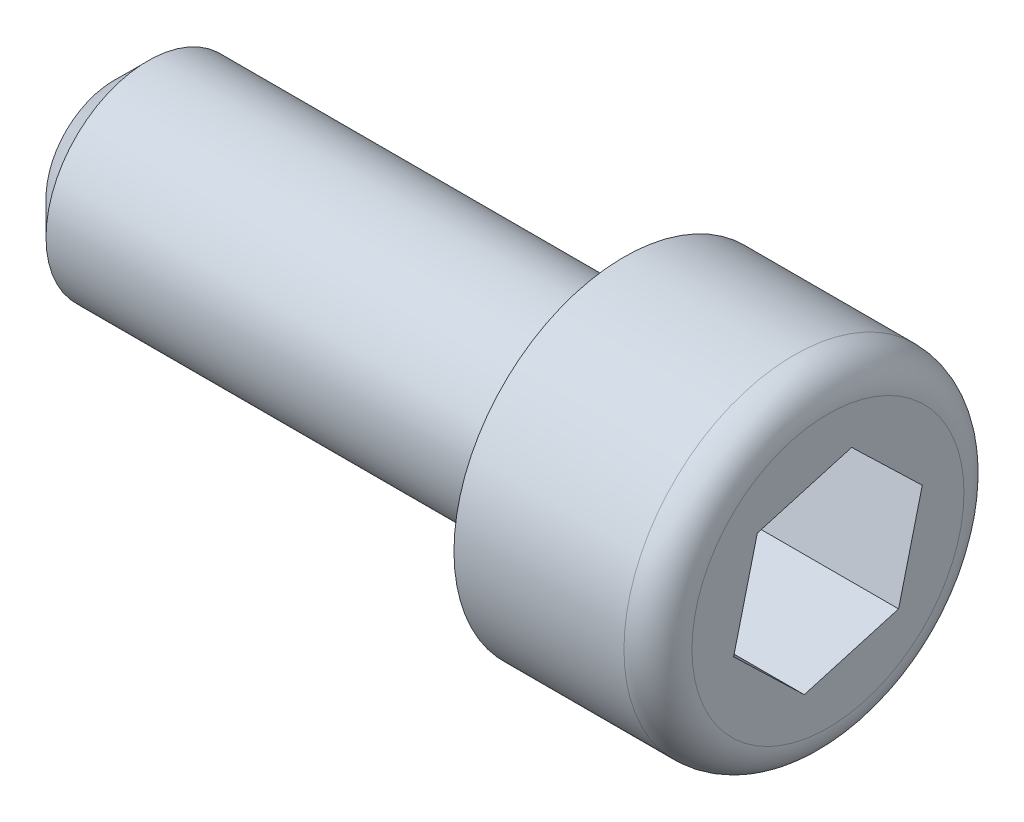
from build123d import *

# Parameters (mm, degrees)
CHANFREIN1_SIZE         = 1
CONG_1_R                = 1
ENL_V_MAT_EXTRU_1_DEPTH = 5


with BuildPart() as part:
    # Esquisse1 → Base-R_volution (revolve)
    with BuildSketch(Plane.XY, mode=Mode.PRIVATE) as base_r_volution_sk:
        Polygon((0, 0), (0, 5), (-6, 5), (-6, 3), (-21, 3), (-21, 0), align=None)
    revolve(base_r_volution_sk.sketch.rotate(Axis((-41, 0, 0), (1, 0, 0)), 90), axis=Axis((-41, 0, 0), (1, 0, 0)))

    # Chanfrein1
    chanfrein1_edges = [part.edges().sort_by_distance(p)[0] for p in [
        (-21, 0, -3),
    ]]
    chamfer(chanfrein1_edges, length=CHANFREIN1_SIZE)

    # Cong_1
    cong_1_edges = [part.edges().sort_by_distance(p)[0] for p in [
        (0, 0, -5),
    ]]
    fillet(cong_1_edges, radius=CONG_1_R)

    # Esquisse2 → Enl_v. mat.-Extru.1 (cut)
    with BuildSketch(Plane(origin=(0, 0, 0), x_dir=(0, 0, -1), z_dir=(1, 0, 0))):
        Polygon((2.078038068, -2.003769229), (2.774334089, 0.797749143), (0.696296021, 2.801518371), (-2.078038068, 2.003769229), (-2.774334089, -0.797749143), (-0.696296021, -2.801518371), align=None)
    extrude(amount=-ENL_V_MAT_EXTRU_1_DEPTH, mode=Mode.SUBTRACT)


solid = part.part
